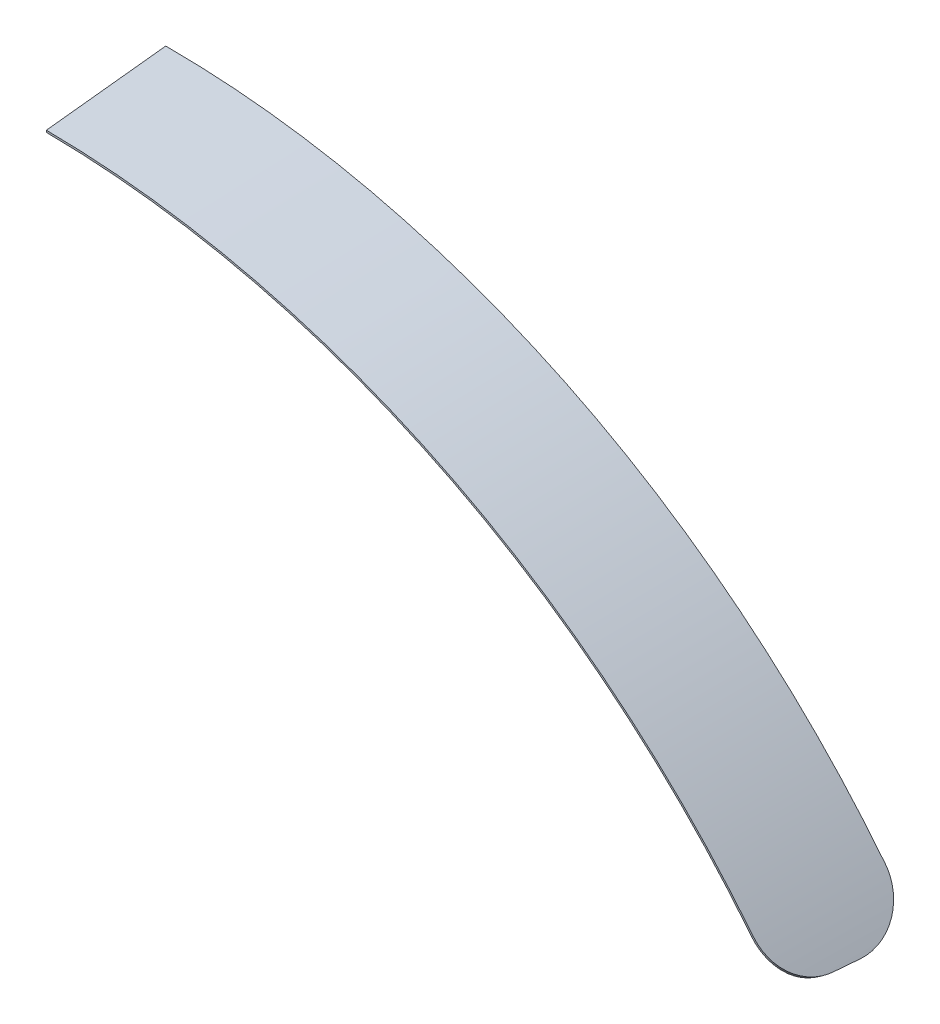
from build123d import *

# Parameters (mm, degrees)
EXTRU_MINCE1_DEPTH = 25
EXTRU_MINCE1_DRAFT = 3
CONG_1_R           = 10


with BuildPart() as part:
    # Esquisse1 → Extru.-Mince1 (with draft: the straight prism first)
    with BuildSketch(Plane.XY):
        with BuildLine():
            Line((0, 182), (0, 179))
            ThreePointArc((0, 179), (82.653001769, 158.774939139), (146.628215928, 102.670182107))
            Line((146.628215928, 102.670182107), (149.085672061, 104.390911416))
            ThreePointArc((149.085672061, 104.390911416), (84.038247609, 161.435971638), (0, 182))
        make_face()
    extrude(amount=EXTRU_MINCE1_DEPTH)
    # Extru.-Mince1: the draft: its side faces are tilted about the plane it starts from
    extru_mince1_sides = [part.faces().sort_by_distance(p)[0] for p in [
        (84.038247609, 161.435971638, 12.5),
        (0, 180.5, 12.5),
        (82.653001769, 158.774939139, 12.5),
        (147.856943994, 103.530546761, 12.5),
    ]]
    draft(extru_mince1_sides, Plane.XY, EXTRU_MINCE1_DRAFT)

    # Cong_1
    cong_1_edges = [part.edges().sort_by_distance(p)[0] for p in [
        (147.101552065, 104.601067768, 25),
        (147.856943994, 103.530546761, 0),
    ]]
    fillet(cong_1_edges, radius=CONG_1_R)


solid = part.part
